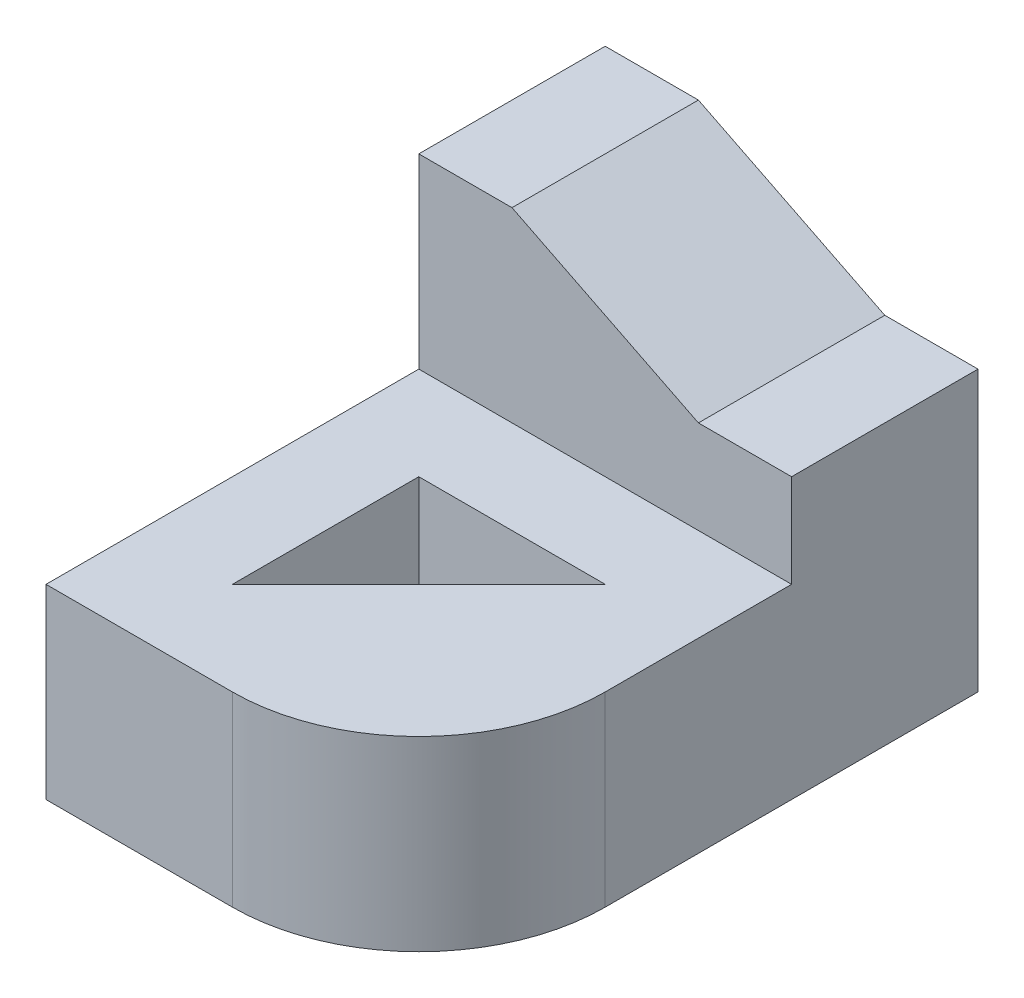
ISO-10303-21;
HEADER;
FILE_DESCRIPTION(('STEP AP214'),'2;1');
FILE_NAME('part.step','',(''),(''),'','','');
FILE_SCHEMA(('AUTOMOTIVE_DESIGN { 1 0 10303 214 1 1 1 1 }'));
ENDSEC;
DATA;
#1=APPLICATION_CONTEXT('core data for automotive mechanical design processes');
#2=APPLICATION_PROTOCOL_DEFINITION('international standard','automotive_design',2000,#1);
#3=PRODUCT_CONTEXT('',#1,'mechanical');
#4=PRODUCT('Part','Part','',(#3));
#5=PRODUCT_RELATED_PRODUCT_CATEGORY('part','',(#4));
#6=PRODUCT_DEFINITION_FORMATION('','',#4);
#7=PRODUCT_DEFINITION_CONTEXT('part definition',#1,'design');
#8=PRODUCT_DEFINITION('design','',#6,#7);
#9=PRODUCT_DEFINITION_SHAPE('','',#8);
#10=(LENGTH_UNIT() NAMED_UNIT(*) SI_UNIT(.MILLI.,.METRE.));
#11=(NAMED_UNIT(*) PLANE_ANGLE_UNIT() SI_UNIT($,.RADIAN.));
#12=(NAMED_UNIT(*) SI_UNIT($,.STERADIAN.) SOLID_ANGLE_UNIT());
#13=UNCERTAINTY_MEASURE_WITH_UNIT(LENGTH_MEASURE(1.E-05),#10,'distance_accuracy_value','');
#14=(GEOMETRIC_REPRESENTATION_CONTEXT(3) GLOBAL_UNCERTAINTY_ASSIGNED_CONTEXT((#13)) GLOBAL_UNIT_ASSIGNED_CONTEXT((#10,
#11,#12)) REPRESENTATION_CONTEXT('',''));
#15=CARTESIAN_POINT('',(0.,0.,0.));
#16=DIRECTION('',(0.,0.,1.));
#17=DIRECTION('',(1.,0.,0.));
#18=AXIS2_PLACEMENT_3D('',#15,#16,#17);
#19=CARTESIAN_POINT('',(14.778933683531,0.,60.));
#20=DIRECTION('',(0.,1.,0.));
#21=DIRECTION('',(0.,0.,1.));
#22=AXIS2_PLACEMENT_3D('',#19,#20,#21);
#23=PLANE('',#22);
#24=DIRECTION('',(0.,0.,1.));
#25=VECTOR('',#24,1.);
#26=CARTESIAN_POINT('',(10.,0.,50.));
#27=LINE('',#26,#25);
#28=CARTESIAN_POINT('',(10.,0.,30.));
#29=VERTEX_POINT('',#28);
#30=CARTESIAN_POINT('',(10.,0.,50.));
#31=VERTEX_POINT('',#30);
#32=EDGE_CURVE('E131',#29,#31,#27,.T.);
#33=ORIENTED_EDGE('',*,*,#32,.T.);
#34=DIRECTION('',(0.707106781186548,0.,-0.707106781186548));
#35=VECTOR('',#34,1.);
#36=CARTESIAN_POINT('',(30.,0.,30.));
#37=LINE('',#36,#35);
#38=CARTESIAN_POINT('',(30.,0.,30.));
#39=VERTEX_POINT('',#38);
#40=EDGE_CURVE('E123',#31,#39,#37,.T.);
#41=ORIENTED_EDGE('',*,*,#40,.T.);
#42=DIRECTION('',(-1.,0.,0.));
#43=VECTOR('',#42,1.);
#44=CARTESIAN_POINT('',(10.,0.,30.));
#45=LINE('',#44,#43);
#46=EDGE_CURVE('E135',#39,#29,#45,.T.);
#47=ORIENTED_EDGE('',*,*,#46,.T.);
#48=EDGE_LOOP('',(#33,#41,#47));
#49=FACE_BOUND('',#48,.T.);
#50=DIRECTION('',(0.,0.,-1.));
#51=VECTOR('',#50,1.);
#52=CARTESIAN_POINT('',(40.,0.,60.));
#53=LINE('',#52,#51);
#54=CARTESIAN_POINT('',(40.,0.,40.));
#55=VERTEX_POINT('',#54);
#56=CARTESIAN_POINT('',(40.,0.,0.));
#57=VERTEX_POINT('',#56);
#58=EDGE_CURVE('E188',#55,#57,#53,.T.);
#59=ORIENTED_EDGE('',*,*,#58,.F.);
#60=CARTESIAN_POINT('',(20.,0.,40.));
#61=DIRECTION('',(0.,1.,0.));
#62=DIRECTION('',(0.,0.,1.));
#63=AXIS2_PLACEMENT_3D('',#60,#61,#62);
#64=CIRCLE('',#63,20.);
#65=CARTESIAN_POINT('',(20.,0.,60.));
#66=VERTEX_POINT('',#65);
#67=EDGE_CURVE('E11',#55,#66,#64,.F.);
#68=ORIENTED_EDGE('',*,*,#67,.T.);
#69=DIRECTION('',(1.,0.,0.));
#70=VECTOR('',#69,1.);
#71=CARTESIAN_POINT('',(14.778933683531,0.,60.));
#72=LINE('',#71,#70);
#73=CARTESIAN_POINT('',(0.,0.,60.));
#74=VERTEX_POINT('',#73);
#75=EDGE_CURVE('E221',#74,#66,#72,.T.);
#76=ORIENTED_EDGE('',*,*,#75,.F.);
#77=DIRECTION('',(0.,0.,-1.));
#78=VECTOR('',#77,1.);
#79=CARTESIAN_POINT('',(0.,0.,60.));
#80=LINE('',#79,#78);
#81=CARTESIAN_POINT('',(0.,0.,0.));
#82=VERTEX_POINT('',#81);
#83=EDGE_CURVE('E212',#74,#82,#80,.T.);
#84=ORIENTED_EDGE('',*,*,#83,.T.);
#85=DIRECTION('',(1.,0.,0.));
#86=VECTOR('',#85,1.);
#87=CARTESIAN_POINT('',(14.778933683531,0.,0.));
#88=LINE('',#87,#86);
#89=EDGE_CURVE('E205',#82,#57,#88,.T.);
#90=ORIENTED_EDGE('',*,*,#89,.T.);
#91=EDGE_LOOP('',(#59,#68,#76,#84,#90));
#92=FACE_BOUND('',#91,.T.);
#93=ADVANCED_FACE('F32',(#49,#92),#23,.F.);
#94=CARTESIAN_POINT('',(40.,-44.2805033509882,60.));
#95=DIRECTION('',(-1.,0.,0.));
#96=DIRECTION('',(0.,0.,1.));
#97=AXIS2_PLACEMENT_3D('',#94,#95,#96);
#98=PLANE('',#97);
#99=DIRECTION('',(0.,0.,-1.));
#100=VECTOR('',#99,1.);
#101=CARTESIAN_POINT('',(40.,20.,60.));
#102=LINE('',#101,#100);
#103=CARTESIAN_POINT('',(40.,20.,40.));
#104=VERTEX_POINT('',#103);
#105=CARTESIAN_POINT('',(40.,20.,20.));
#106=VERTEX_POINT('',#105);
#107=EDGE_CURVE('E189',#104,#106,#102,.T.);
#108=ORIENTED_EDGE('',*,*,#107,.F.);
#109=DIRECTION('',(0.,1.,0.));
#110=VECTOR('',#109,1.);
#111=CARTESIAN_POINT('',(40.,0.,40.));
#112=LINE('',#111,#110);
#113=EDGE_CURVE('E40',#104,#55,#112,.F.);
#114=ORIENTED_EDGE('',*,*,#113,.T.);
#115=ORIENTED_EDGE('',*,*,#58,.T.);
#116=DIRECTION('',(0.,1.,0.));
#117=VECTOR('',#116,1.);
#118=CARTESIAN_POINT('',(40.,-44.2805033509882,0.));
#119=LINE('',#118,#117);
#120=CARTESIAN_POINT('',(40.,30.,0.));
#121=VERTEX_POINT('',#120);
#122=EDGE_CURVE('E197',#57,#121,#119,.T.);
#123=ORIENTED_EDGE('',*,*,#122,.T.);
#124=DIRECTION('',(0.,0.,-1.));
#125=VECTOR('',#124,1.);
#126=CARTESIAN_POINT('',(40.,30.,20.));
#127=LINE('',#126,#125);
#128=CARTESIAN_POINT('',(40.,30.,20.));
#129=VERTEX_POINT('',#128);
#130=EDGE_CURVE('E213',#129,#121,#127,.T.);
#131=ORIENTED_EDGE('',*,*,#130,.F.);
#132=DIRECTION('',(0.,-1.,0.));
#133=VECTOR('',#132,1.);
#134=CARTESIAN_POINT('',(40.,-44.2805033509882,20.));
#135=LINE('',#134,#133);
#136=EDGE_CURVE('E157',#129,#106,#135,.T.);
#137=ORIENTED_EDGE('',*,*,#136,.T.);
#138=EDGE_LOOP('',(#108,#114,#115,#123,#131,#137));
#139=FACE_BOUND('',#138,.T.);
#140=ADVANCED_FACE('F196',(#139),#98,.F.);
#141=CARTESIAN_POINT('',(14.778933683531,20.,60.));
#142=DIRECTION('',(0.,1.,0.));
#143=DIRECTION('',(0.,0.,1.));
#144=AXIS2_PLACEMENT_3D('',#141,#142,#143);
#145=PLANE('',#144);
#146=DIRECTION('',(0.707106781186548,0.,-0.707106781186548));
#147=VECTOR('',#146,1.);
#148=CARTESIAN_POINT('',(30.,20.,30.));
#149=LINE('',#148,#147);
#150=CARTESIAN_POINT('',(10.,20.,50.));
#151=VERTEX_POINT('',#150);
#152=CARTESIAN_POINT('',(30.,20.,30.));
#153=VERTEX_POINT('',#152);
#154=EDGE_CURVE('E126',#151,#153,#149,.T.);
#155=ORIENTED_EDGE('',*,*,#154,.F.);
#156=DIRECTION('',(0.,0.,1.));
#157=VECTOR('',#156,1.);
#158=CARTESIAN_POINT('',(10.,20.,50.));
#159=LINE('',#158,#157);
#160=CARTESIAN_POINT('',(10.,20.,30.));
#161=VERTEX_POINT('',#160);
#162=EDGE_CURVE('E140',#161,#151,#159,.T.);
#163=ORIENTED_EDGE('',*,*,#162,.F.);
#164=DIRECTION('',(-1.,0.,0.));
#165=VECTOR('',#164,1.);
#166=CARTESIAN_POINT('',(10.,20.,30.));
#167=LINE('',#166,#165);
#168=EDGE_CURVE('E143',#153,#161,#167,.T.);
#169=ORIENTED_EDGE('',*,*,#168,.F.);
#170=EDGE_LOOP('',(#155,#163,#169));
#171=FACE_BOUND('',#170,.T.);
#172=DIRECTION('',(1.,0.,0.));
#173=VECTOR('',#172,1.);
#174=CARTESIAN_POINT('',(14.778933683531,20.,60.));
#175=LINE('',#174,#173);
#176=CARTESIAN_POINT('',(0.,20.,60.));
#177=VERTEX_POINT('',#176);
#178=CARTESIAN_POINT('',(20.,20.,60.));
#179=VERTEX_POINT('',#178);
#180=EDGE_CURVE('E224',#177,#179,#175,.T.);
#181=ORIENTED_EDGE('',*,*,#180,.T.);
#182=CARTESIAN_POINT('',(20.,20.,40.));
#183=DIRECTION('',(0.,1.,0.));
#184=DIRECTION('',(0.,0.,1.));
#185=AXIS2_PLACEMENT_3D('',#182,#183,#184);
#186=CIRCLE('',#185,20.);
#187=EDGE_CURVE('E54',#179,#104,#186,.T.);
#188=ORIENTED_EDGE('',*,*,#187,.T.);
#189=ORIENTED_EDGE('',*,*,#107,.T.);
#190=DIRECTION('',(1.,0.,0.));
#191=VECTOR('',#190,1.);
#192=CARTESIAN_POINT('',(14.778933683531,20.,20.));
#193=LINE('',#192,#191);
#194=CARTESIAN_POINT('',(0.,20.,20.));
#195=VERTEX_POINT('',#194);
#196=EDGE_CURVE('E168',#195,#106,#193,.T.);
#197=ORIENTED_EDGE('',*,*,#196,.F.);
#198=DIRECTION('',(0.,0.,-1.));
#199=VECTOR('',#198,1.);
#200=CARTESIAN_POINT('',(0.,20.,60.));
#201=LINE('',#200,#199);
#202=EDGE_CURVE('E173',#177,#195,#201,.T.);
#203=ORIENTED_EDGE('',*,*,#202,.F.);
#204=EDGE_LOOP('',(#181,#188,#189,#197,#203));
#205=FACE_BOUND('',#204,.T.);
#206=ADVANCED_FACE('F251',(#171,#205),#145,.T.);
#207=CARTESIAN_POINT('',(0.,-44.2805033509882,60.));
#208=DIRECTION('',(-1.,0.,0.));
#209=DIRECTION('',(0.,0.,1.));
#210=AXIS2_PLACEMENT_3D('',#207,#208,#209);
#211=PLANE('',#210);
#212=DIRECTION('',(0.,1.,0.));
#213=VECTOR('',#212,1.);
#214=CARTESIAN_POINT('',(0.,-44.2805033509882,0.));
#215=LINE('',#214,#213);
#216=CARTESIAN_POINT('',(0.,40.,0.));
#217=VERTEX_POINT('',#216);
#218=EDGE_CURVE('E209',#82,#217,#215,.T.);
#219=ORIENTED_EDGE('',*,*,#218,.F.);
#220=ORIENTED_EDGE('',*,*,#83,.F.);
#221=DIRECTION('',(0.,1.,0.));
#222=VECTOR('',#221,1.);
#223=CARTESIAN_POINT('',(0.,-44.2805033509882,60.));
#224=LINE('',#223,#222);
#225=EDGE_CURVE('E218',#74,#177,#224,.T.);
#226=ORIENTED_EDGE('',*,*,#225,.T.);
#227=ORIENTED_EDGE('',*,*,#202,.T.);
#228=DIRECTION('',(0.,1.,0.));
#229=VECTOR('',#228,1.);
#230=CARTESIAN_POINT('',(0.,-44.2805033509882,20.));
#231=LINE('',#230,#229);
#232=CARTESIAN_POINT('',(0.,40.,20.));
#233=VERTEX_POINT('',#232);
#234=EDGE_CURVE('E163',#195,#233,#231,.T.);
#235=ORIENTED_EDGE('',*,*,#234,.T.);
#236=DIRECTION('',(0.,0.,-1.));
#237=VECTOR('',#236,1.);
#238=CARTESIAN_POINT('',(0.,40.,20.));
#239=LINE('',#238,#237);
#240=EDGE_CURVE('E172',#233,#217,#239,.T.);
#241=ORIENTED_EDGE('',*,*,#240,.T.);
#242=EDGE_LOOP('',(#219,#220,#226,#227,#235,#241));
#243=FACE_BOUND('',#242,.T.);
#244=ADVANCED_FACE('F252',(#243),#211,.T.);
#245=CARTESIAN_POINT('',(14.778933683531,-44.2805033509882,60.));
#246=DIRECTION('',(0.,0.,1.));
#247=DIRECTION('',(1.,0.,0.));
#248=AXIS2_PLACEMENT_3D('',#245,#246,#247);
#249=PLANE('',#248);
#250=ORIENTED_EDGE('',*,*,#75,.T.);
#251=DIRECTION('',(0.,1.,0.));
#252=VECTOR('',#251,1.);
#253=CARTESIAN_POINT('',(20.,20.,60.));
#254=LINE('',#253,#252);
#255=EDGE_CURVE('E185',#66,#179,#254,.T.);
#256=ORIENTED_EDGE('',*,*,#255,.T.);
#257=ORIENTED_EDGE('',*,*,#180,.F.);
#258=ORIENTED_EDGE('',*,*,#225,.F.);
#259=EDGE_LOOP('',(#250,#256,#257,#258));
#260=FACE_BOUND('',#259,.T.);
#261=ADVANCED_FACE('F274',(#260),#249,.T.);
#262=CARTESIAN_POINT('',(14.778933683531,-44.2805033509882,0.));
#263=DIRECTION('',(0.,0.,1.));
#264=DIRECTION('',(1.,0.,0.));
#265=AXIS2_PLACEMENT_3D('',#262,#263,#264);
#266=PLANE('',#265);
#267=ORIENTED_EDGE('',*,*,#89,.F.);
#268=ORIENTED_EDGE('',*,*,#218,.T.);
#269=DIRECTION('',(1.,0.,0.));
#270=VECTOR('',#269,1.);
#271=CARTESIAN_POINT('',(14.778933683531,40.,0.));
#272=LINE('',#271,#270);
#273=CARTESIAN_POINT('',(10.,40.,0.));
#274=VERTEX_POINT('',#273);
#275=EDGE_CURVE('E178',#217,#274,#272,.T.);
#276=ORIENTED_EDGE('',*,*,#275,.T.);
#277=DIRECTION('',(0.894427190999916,-0.447213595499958,0.));
#278=VECTOR('',#277,1.);
#279=CARTESIAN_POINT('',(47.5353482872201,21.23232585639,0.));
#280=LINE('',#279,#278);
#281=CARTESIAN_POINT('',(30.,30.,0.));
#282=VERTEX_POINT('',#281);
#283=EDGE_CURVE('E237',#274,#282,#280,.T.);
#284=ORIENTED_EDGE('',*,*,#283,.T.);
#285=DIRECTION('',(1.,0.,0.));
#286=VECTOR('',#285,1.);
#287=CARTESIAN_POINT('',(14.778933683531,30.,0.));
#288=LINE('',#287,#286);
#289=EDGE_CURVE('E151',#282,#121,#288,.T.);
#290=ORIENTED_EDGE('',*,*,#289,.T.);
#291=ORIENTED_EDGE('',*,*,#122,.F.);
#292=EDGE_LOOP('',(#267,#268,#276,#284,#290,#291));
#293=FACE_BOUND('',#292,.T.);
#294=ADVANCED_FACE('F204',(#293),#266,.F.);
#295=CARTESIAN_POINT('',(14.778933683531,30.,20.));
#296=DIRECTION('',(0.,1.,0.));
#297=DIRECTION('',(0.,0.,1.));
#298=AXIS2_PLACEMENT_3D('',#295,#296,#297);
#299=PLANE('',#298);
#300=ORIENTED_EDGE('',*,*,#289,.F.);
#301=DIRECTION('',(0.,0.,-1.));
#302=VECTOR('',#301,1.);
#303=CARTESIAN_POINT('',(30.,30.,20.));
#304=LINE('',#303,#302);
#305=CARTESIAN_POINT('',(30.,30.,20.));
#306=VERTEX_POINT('',#305);
#307=EDGE_CURVE('E215',#306,#282,#304,.T.);
#308=ORIENTED_EDGE('',*,*,#307,.F.);
#309=DIRECTION('',(1.,0.,0.));
#310=VECTOR('',#309,1.);
#311=CARTESIAN_POINT('',(14.778933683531,30.,20.));
#312=LINE('',#311,#310);
#313=EDGE_CURVE('E153',#306,#129,#312,.T.);
#314=ORIENTED_EDGE('',*,*,#313,.T.);
#315=ORIENTED_EDGE('',*,*,#130,.T.);
#316=EDGE_LOOP('',(#300,#308,#314,#315));
#317=FACE_BOUND('',#316,.T.);
#318=ADVANCED_FACE('F245',(#317),#299,.T.);
#319=CARTESIAN_POINT('',(47.5353482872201,21.23232585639,20.));
#320=DIRECTION('',(0.447213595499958,0.894427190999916,0.));
#321=DIRECTION('',(-0.894427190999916,0.447213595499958,0.));
#322=AXIS2_PLACEMENT_3D('',#319,#320,#321);
#323=PLANE('',#322);
#324=ORIENTED_EDGE('',*,*,#283,.F.);
#325=DIRECTION('',(0.,0.,-1.));
#326=VECTOR('',#325,1.);
#327=CARTESIAN_POINT('',(10.,40.,20.));
#328=LINE('',#327,#326);
#329=CARTESIAN_POINT('',(10.,40.,20.));
#330=VERTEX_POINT('',#329);
#331=EDGE_CURVE('E232',#330,#274,#328,.T.);
#332=ORIENTED_EDGE('',*,*,#331,.F.);
#333=DIRECTION('',(0.894427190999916,-0.447213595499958,0.));
#334=VECTOR('',#333,1.);
#335=CARTESIAN_POINT('',(47.5353482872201,21.23232585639,20.));
#336=LINE('',#335,#334);
#337=EDGE_CURVE('E156',#330,#306,#336,.T.);
#338=ORIENTED_EDGE('',*,*,#337,.T.);
#339=ORIENTED_EDGE('',*,*,#307,.T.);
#340=EDGE_LOOP('',(#324,#332,#338,#339));
#341=FACE_BOUND('',#340,.T.);
#342=ADVANCED_FACE('F241',(#341),#323,.T.);
#343=CARTESIAN_POINT('',(14.778933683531,40.,20.));
#344=DIRECTION('',(0.,1.,0.));
#345=DIRECTION('',(0.,0.,1.));
#346=AXIS2_PLACEMENT_3D('',#343,#344,#345);
#347=PLANE('',#346);
#348=ORIENTED_EDGE('',*,*,#275,.F.);
#349=ORIENTED_EDGE('',*,*,#240,.F.);
#350=DIRECTION('',(1.,0.,0.));
#351=VECTOR('',#350,1.);
#352=CARTESIAN_POINT('',(14.778933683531,40.,20.));
#353=LINE('',#352,#351);
#354=EDGE_CURVE('E160',#233,#330,#353,.T.);
#355=ORIENTED_EDGE('',*,*,#354,.T.);
#356=ORIENTED_EDGE('',*,*,#331,.T.);
#357=EDGE_LOOP('',(#348,#349,#355,#356));
#358=FACE_BOUND('',#357,.T.);
#359=ADVANCED_FACE('F254',(#358),#347,.T.);
#360=CARTESIAN_POINT('',(14.778933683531,-44.2805033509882,20.));
#361=DIRECTION('',(0.,0.,1.));
#362=DIRECTION('',(1.,0.,0.));
#363=AXIS2_PLACEMENT_3D('',#360,#361,#362);
#364=PLANE('',#363);
#365=ORIENTED_EDGE('',*,*,#136,.F.);
#366=ORIENTED_EDGE('',*,*,#313,.F.);
#367=ORIENTED_EDGE('',*,*,#337,.F.);
#368=ORIENTED_EDGE('',*,*,#354,.F.);
#369=ORIENTED_EDGE('',*,*,#234,.F.);
#370=ORIENTED_EDGE('',*,*,#196,.T.);
#371=EDGE_LOOP('',(#365,#366,#367,#368,#369,#370));
#372=FACE_BOUND('',#371,.T.);
#373=ADVANCED_FACE('F248',(#372),#364,.T.);
#374=CARTESIAN_POINT('',(30.,0.,30.));
#375=DIRECTION('',(0.707106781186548,0.,0.707106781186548));
#376=DIRECTION('',(0.707106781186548,0.,-0.707106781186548));
#377=AXIS2_PLACEMENT_3D('',#374,#375,#376);
#378=PLANE('',#377);
#379=ORIENTED_EDGE('',*,*,#154,.T.);
#380=DIRECTION('',(0.,1.,0.));
#381=VECTOR('',#380,1.);
#382=CARTESIAN_POINT('',(30.,0.,30.));
#383=LINE('',#382,#381);
#384=EDGE_CURVE('E119',#39,#153,#383,.T.);
#385=ORIENTED_EDGE('',*,*,#384,.F.);
#386=ORIENTED_EDGE('',*,*,#40,.F.);
#387=DIRECTION('',(0.,1.,0.));
#388=VECTOR('',#387,1.);
#389=CARTESIAN_POINT('',(10.,0.,50.));
#390=LINE('',#389,#388);
#391=EDGE_CURVE('E149',#31,#151,#390,.T.);
#392=ORIENTED_EDGE('',*,*,#391,.T.);
#393=EDGE_LOOP('',(#379,#385,#386,#392));
#394=FACE_BOUND('',#393,.T.);
#395=ADVANCED_FACE('F121',(#394),#378,.F.);
#396=CARTESIAN_POINT('',(10.,0.,50.));
#397=DIRECTION('',(-1.,0.,0.));
#398=DIRECTION('',(0.,0.,1.));
#399=AXIS2_PLACEMENT_3D('',#396,#397,#398);
#400=PLANE('',#399);
#401=ORIENTED_EDGE('',*,*,#162,.T.);
#402=ORIENTED_EDGE('',*,*,#391,.F.);
#403=ORIENTED_EDGE('',*,*,#32,.F.);
#404=DIRECTION('',(0.,1.,0.));
#405=VECTOR('',#404,1.);
#406=CARTESIAN_POINT('',(10.,0.,30.));
#407=LINE('',#406,#405);
#408=EDGE_CURVE('E130',#29,#161,#407,.T.);
#409=ORIENTED_EDGE('',*,*,#408,.T.);
#410=EDGE_LOOP('',(#401,#402,#403,#409));
#411=FACE_BOUND('',#410,.T.);
#412=ADVANCED_FACE('F308',(#411),#400,.F.);
#413=CARTESIAN_POINT('',(10.,0.,30.));
#414=DIRECTION('',(0.,0.,-1.));
#415=DIRECTION('',(-1.,0.,0.));
#416=AXIS2_PLACEMENT_3D('',#413,#414,#415);
#417=PLANE('',#416);
#418=ORIENTED_EDGE('',*,*,#168,.T.);
#419=ORIENTED_EDGE('',*,*,#408,.F.);
#420=ORIENTED_EDGE('',*,*,#46,.F.);
#421=ORIENTED_EDGE('',*,*,#384,.T.);
#422=EDGE_LOOP('',(#418,#419,#420,#421));
#423=FACE_BOUND('',#422,.T.);
#424=ADVANCED_FACE('F136',(#423),#417,.F.);
#425=CARTESIAN_POINT('',(20.,-44.2805033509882,40.));
#426=DIRECTION('',(0.,-1.,0.));
#427=DIRECTION('',(0.,0.,-1.));
#428=AXIS2_PLACEMENT_3D('',#425,#426,#427);
#429=CYLINDRICAL_SURFACE('',#428,20.);
#430=ORIENTED_EDGE('',*,*,#67,.F.);
#431=ORIENTED_EDGE('',*,*,#113,.F.);
#432=ORIENTED_EDGE('',*,*,#187,.F.);
#433=ORIENTED_EDGE('',*,*,#255,.F.);
#434=EDGE_LOOP('',(#430,#431,#432,#433));
#435=FACE_BOUND('',#434,.T.);
#436=ADVANCED_FACE('F34',(#435),#429,.T.);
#437=CLOSED_SHELL('',(#93,#140,#206,#244,#261,#294,#318,#342,#359,#373,#395,#412,#424,#436));
#438=MANIFOLD_SOLID_BREP('B2',#437);
#439=ADVANCED_BREP_SHAPE_REPRESENTATION('',(#18,#438),#14);
#440=SHAPE_DEFINITION_REPRESENTATION(#9,#439);
ENDSEC;
END-ISO-10303-21;
